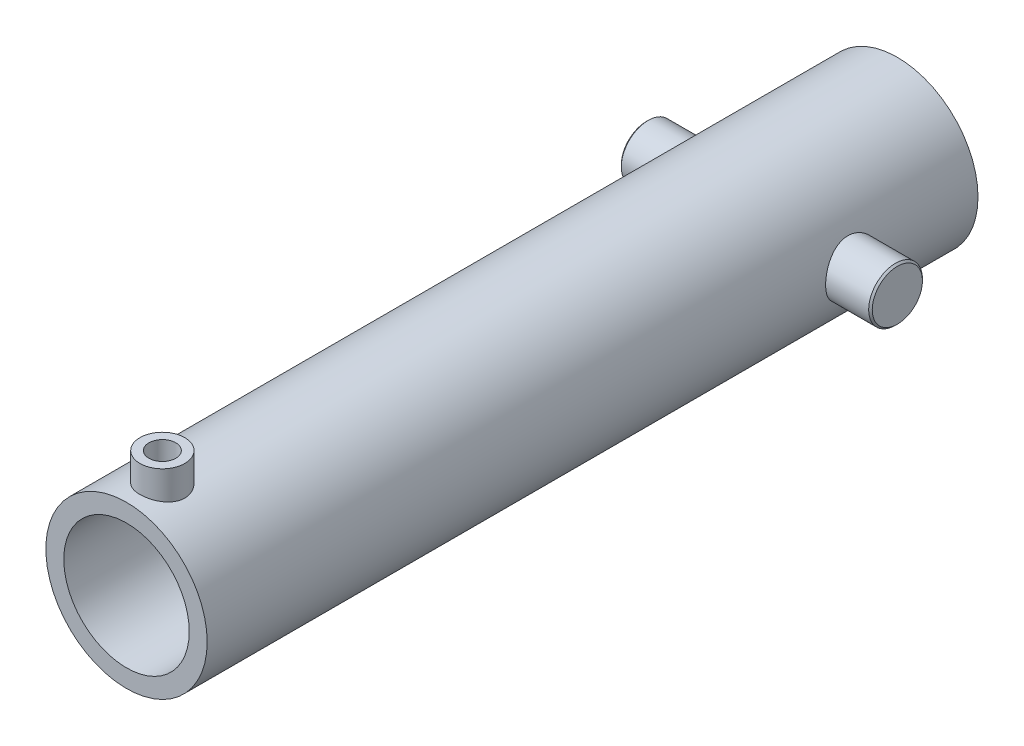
from build123d import *

# Parameters (mm, degrees)
ESQUISSE1_R                  = 45
ESQUISSE1_R_2                = 35
EXTRU_MINCE1_DEPTH           = 430
EXTRUSION2_REACH             = 446.916
EXTRUSION2_END_RADIUS        = 45
ESQUISSE2_R                  = 12.5
ENL_V_MAT_EXTRU_2_REACH      = 446.916
ENL_V_MAT_EXTRU_2_END_RADIUS = 35
ESQUISSE3_R                  = 7.5
EXTRUSION3_REACH             = 451.138
EXTRUSION3_END_RADIUS        = 45
ESQUISSE4_R                  = 15
CHANFREIN1_SIZE              = 1
R_P_TITION_CIRCULAIRE2_COUNT = 2


with BuildPart() as part:
    # Esquisse1 → Extru.-Mince1 (new body)
    with BuildSketch(Plane.XY):
        Circle(ESQUISSE1_R)
        Circle(ESQUISSE1_R_2, mode=Mode.SUBTRACT)
    extrude(amount=EXTRU_MINCE1_DEPTH)

    # Extrusion2: up to this cylinder (the profile starts outside it)
    extrusion2_end = Plane(origin=(0, 0, 410), z_dir=(0, 0, -1)) * Cylinder(EXTRUSION2_END_RADIUS, 984.832, mode=Mode.PRIVATE)
    # Esquisse2 → Extrusion2 (add, up to the surface)
    with BuildSketch(Plane(origin=(0, 60, 0), x_dir=(-1, 0, 0), z_dir=(0, 1, 0)), mode=Mode.PRIVATE) as extrusion2_sk1:
        with Locations(Location((0, 410, 0), (0, 0, 90))):
            Circle(ESQUISSE2_R)
    extrusion2_tool1 = extrude(extrusion2_sk1.sketch, amount=-EXTRUSION2_REACH, mode=Mode.PRIVATE) - extrusion2_end
    add(extrusion2_tool1.solids().sort_by_distance((0, 60, 410))[0])

    # Enl_v. mat.-Extru.2: up to this cylinder (the profile starts outside it)
    enl_v_mat_extru_2_end = Plane(origin=(0, 0, 410), z_dir=(0, 0, -1)) * Cylinder(ENL_V_MAT_EXTRU_2_END_RADIUS, 964.832, mode=Mode.PRIVATE)
    # Esquisse3 → Enl_v. mat.-Extru.2 (cut, up to the surface)
    with BuildSketch(Plane(origin=(0, 60, 0), x_dir=(-1, 0, 0), z_dir=(0, 1, 0)), mode=Mode.PRIVATE) as enl_v_mat_extru_2_sk1:
        with Locations(Location((0, 410, 0), (0, 0, 90))):
            Circle(ESQUISSE3_R)
    enl_v_mat_extru_2_tool1 = extrude(enl_v_mat_extru_2_sk1.sketch, amount=-ENL_V_MAT_EXTRU_2_REACH, mode=Mode.PRIVATE) - enl_v_mat_extru_2_end
    add(enl_v_mat_extru_2_tool1.solids().sort_by_distance((0, 60, 410))[0], mode=Mode.SUBTRACT)


with BuildPart() as body_2:
    # Extrusion3: up to this cylinder (the profile starts outside it)
    extrusion3_end = Plane(origin=(0, 0, 70), z_dir=(0, 0, -1)) * Cylinder(EXTRUSION3_END_RADIUS, 993.276, mode=Mode.PRIVATE)
    # Esquisse4 → Extrusion3 (new, up to the surface)
    with BuildSketch(Plane(origin=(70, 0, 0), x_dir=(0, 0, -1), z_dir=(1, 0, 0)), mode=Mode.PRIVATE) as extrusion3_sk1:
        with Locations((-70, 0)):
            Circle(ESQUISSE4_R)
    extrusion3_tool1 = extrude(extrusion3_sk1.sketch, amount=-EXTRUSION3_REACH, mode=Mode.PRIVATE) - extrusion3_end
    add(extrusion3_tool1.solids().sort_by_distance((70, 0, 70))[0])

    # Chanfrein1
    chanfrein1_edges = [body_2.edges().sort_by_distance(p)[0] for p in [
        (70, 0, 85),
    ]]
    chamfer(chanfrein1_edges, length=CHANFREIN1_SIZE)


with BuildPart() as r_p_tition_circulaire2_1:
    # R_p_tition circulaire2: pattern copy
    add(body_2.part.rotate(Axis((0, 0, 0), (0, 0, 1)), 1 * 360 / R_P_TITION_CIRCULAIRE2_COUNT))


solid = Compound([part.part, body_2.part, r_p_tition_circulaire2_1.part])
